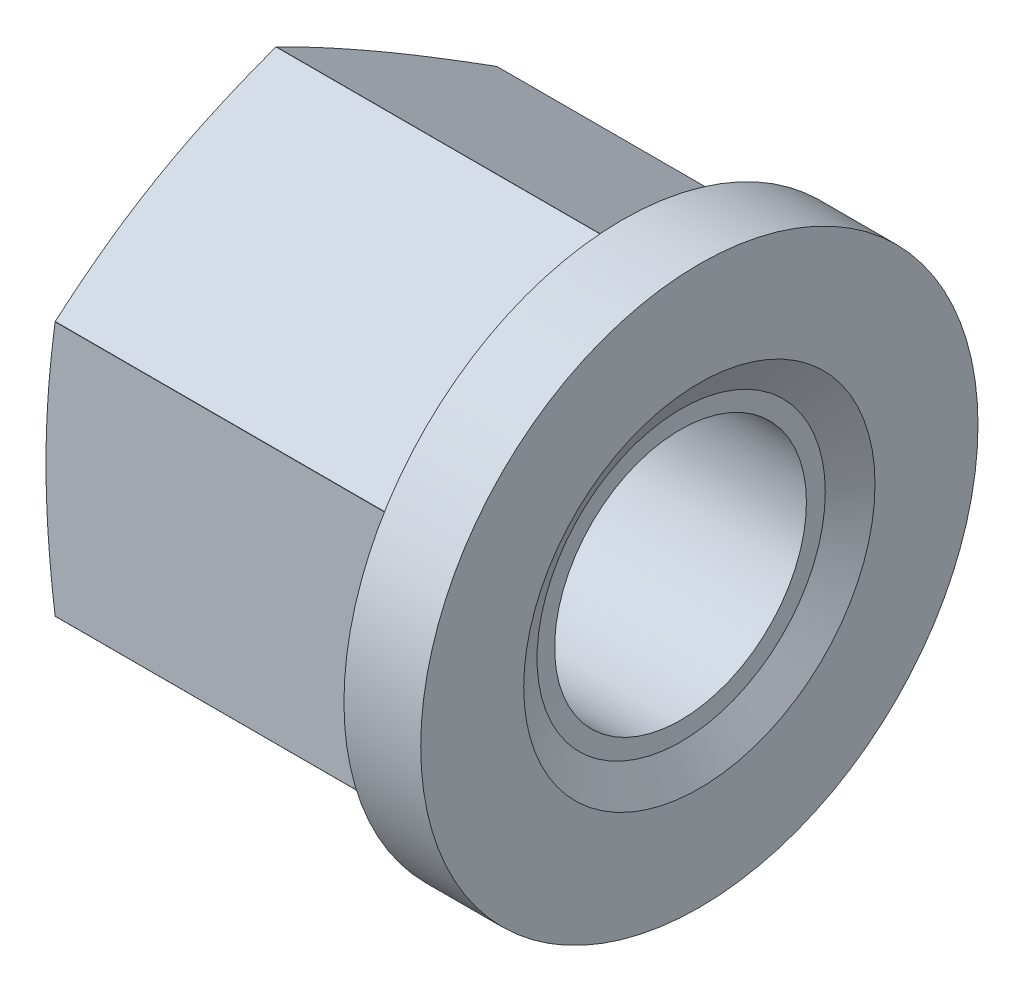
from build123d import *

# Parameters (mm, degrees)
ESQUISSE2_W             = 92
ESQUISSE2_H             = 92
ENL_V_MAT_EXTRU_1_DEPTH = 37.01


with BuildPart() as part:
    # Esquisse1 → R_volution1 (revolve)
    with BuildSketch(Plane.XY, mode=Mode.PRIVATE) as r_volution1_sk:
        Polygon((-45, 18.281370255), (-43.1055, 15), (-43.039342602, 13.1055), (-1.960657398, 13.1055), (-1.8945, 15), (0, 18.281370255), (0, 29), (-8, 29), (-8, 26.55), (-44.048780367, 26.55), (-45, 23), align=None)
    revolve(r_volution1_sk.sketch.rotate(Axis((0, 0, 0), (-1, 0, 0)), 90), axis=Axis((0, 0, 0), (-1, 0, 0)))

    # Esquisse2 → Enl_v. mat.-Extru.1 (cut)
    with BuildSketch(Plane(origin=(-45, 0, 0), x_dir=(0, 0, -1), z_dir=(1, 0, 0))):
        Rectangle(ESQUISSE2_W, ESQUISSE2_H)
        Polygon((-23, 13.279056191), (-23, -13.279056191), (0, -26.558112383), (23, -13.279056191), (23, 13.279056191), (0, 26.558112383), align=None, mode=Mode.SUBTRACT)
    extrude(amount=ENL_V_MAT_EXTRU_1_DEPTH, mode=Mode.SUBTRACT)


solid = part.part
